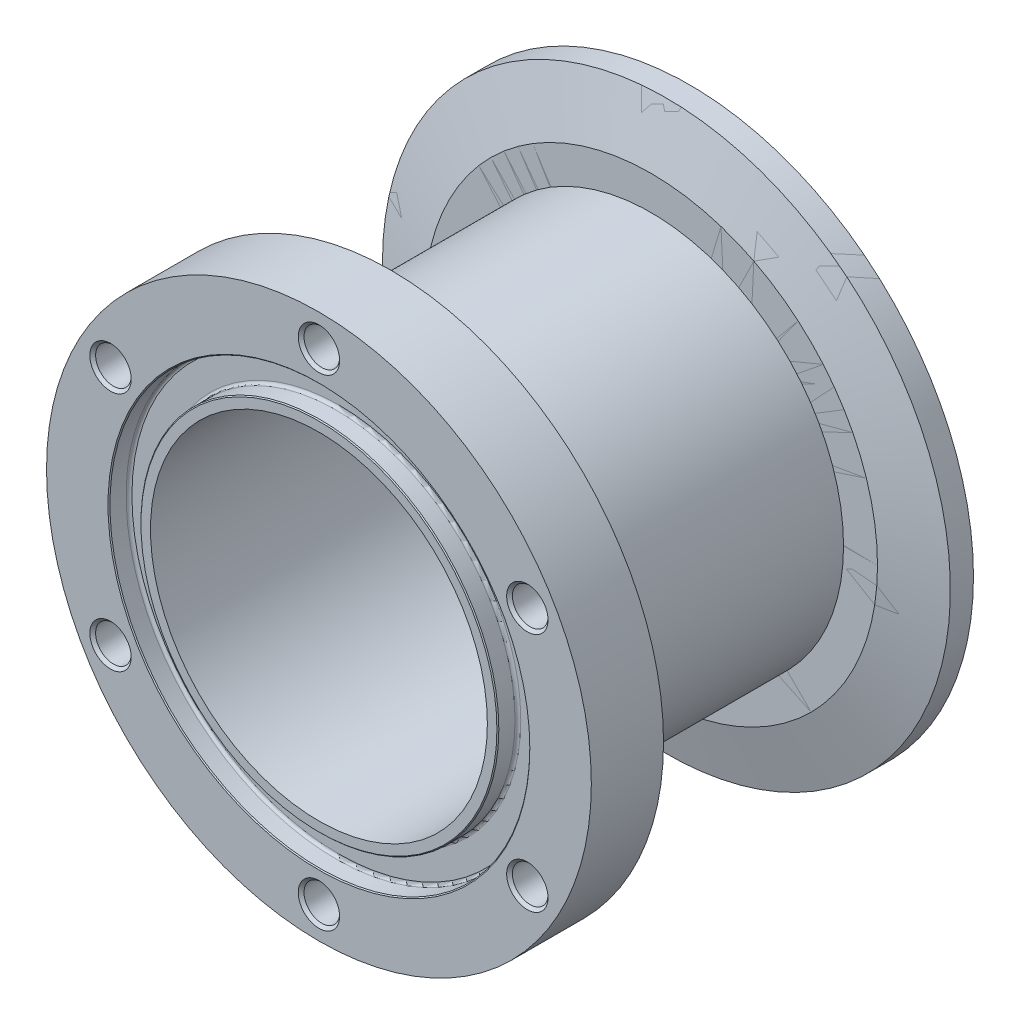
ISO-10303-21;
HEADER;
FILE_DESCRIPTION(('STEP AP214'),'2;1');
FILE_NAME('part.step','',(''),(''),'','','');
FILE_SCHEMA(('AUTOMOTIVE_DESIGN { 1 0 10303 214 1 1 1 1 }'));
ENDSEC;
DATA;
#1=APPLICATION_CONTEXT('core data for automotive mechanical design processes');
#2=APPLICATION_PROTOCOL_DEFINITION('international standard','automotive_design',2000,#1);
#3=PRODUCT_CONTEXT('',#1,'mechanical');
#4=PRODUCT('Part','Part','',(#3));
#5=PRODUCT_RELATED_PRODUCT_CATEGORY('part','',(#4));
#6=PRODUCT_DEFINITION_FORMATION('','',#4);
#7=PRODUCT_DEFINITION_CONTEXT('part definition',#1,'design');
#8=PRODUCT_DEFINITION('design','',#6,#7);
#9=PRODUCT_DEFINITION_SHAPE('','',#8);
#10=(LENGTH_UNIT() NAMED_UNIT(*) SI_UNIT(.MILLI.,.METRE.));
#11=(NAMED_UNIT(*) PLANE_ANGLE_UNIT() SI_UNIT($,.RADIAN.));
#12=(NAMED_UNIT(*) SI_UNIT($,.STERADIAN.) SOLID_ANGLE_UNIT());
#13=UNCERTAINTY_MEASURE_WITH_UNIT(LENGTH_MEASURE(1.E-05),#10,'distance_accuracy_value','');
#14=(GEOMETRIC_REPRESENTATION_CONTEXT(3) GLOBAL_UNCERTAINTY_ASSIGNED_CONTEXT((#13)) GLOBAL_UNIT_ASSIGNED_CONTEXT((#10,
#11,#12)) REPRESENTATION_CONTEXT('',''));
#15=CARTESIAN_POINT('',(0.,0.,0.));
#16=DIRECTION('',(0.,0.,1.));
#17=DIRECTION('',(1.,0.,0.));
#18=AXIS2_PLACEMENT_3D('',#15,#16,#17);
#19=CARTESIAN_POINT('',(0.,0.,46.355));
#20=DIRECTION('',(0.,0.,1.));
#21=DIRECTION('',(1.,0.,0.));
#22=AXIS2_PLACEMENT_3D('',#19,#20,#21);
#23=PLANE('',#22);
#24=CARTESIAN_POINT('',(0.,0.,46.355));
#25=DIRECTION('',(0.,0.,1.));
#26=DIRECTION('',(1.,0.,0.));
#27=AXIS2_PLACEMENT_3D('',#24,#25,#26);
#28=CIRCLE('',#27,23.4823);
#29=CARTESIAN_POINT('',(23.4823,0.,46.355));
#30=VERTEX_POINT('',#29);
#31=EDGE_CURVE('P0_E132',#30,#30,#28,.T.);
#32=ORIENTED_EDGE('',*,*,#31,.T.);
#33=EDGE_LOOP('',(#32));
#34=FACE_BOUND('',#33,.T.);
#35=CARTESIAN_POINT('',(0.,0.,46.355));
#36=DIRECTION('',(0.,0.,1.));
#37=DIRECTION('',(1.,0.,0.));
#38=AXIS2_PLACEMENT_3D('',#35,#36,#37);
#39=CIRCLE('',#38,22.225);
#40=CARTESIAN_POINT('',(22.225,0.,46.355));
#41=VERTEX_POINT('',#40);
#42=EDGE_CURVE('P0_E94',#41,#41,#39,.T.);
#43=ORIENTED_EDGE('',*,*,#42,.F.);
#44=EDGE_LOOP('',(#43));
#45=FACE_BOUND('',#44,.T.);
#46=ADVANCED_FACE('P0_F42',(#34,#45),#23,.T.);
#47=CARTESIAN_POINT('',(0.,0.,2.54));
#48=DIRECTION('',(0.,0.,-1.));
#49=DIRECTION('',(0.,-1.,0.));
#50=AXIS2_PLACEMENT_3D('',#47,#48,#49);
#51=PLANE('',#50);
#52=CARTESIAN_POINT('',(0.,0.,2.54));
#53=DIRECTION('',(0.,0.,-1.));
#54=DIRECTION('',(-1.,0.,0.));
#55=AXIS2_PLACEMENT_3D('',#52,#53,#54);
#56=CIRCLE('',#55,29.88147275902);
#57=CARTESIAN_POINT('',(-29.88147275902,0.,2.54));
#58=VERTEX_POINT('',#57);
#59=EDGE_CURVE('P0_E57',#58,#58,#56,.T.);
#60=ORIENTED_EDGE('',*,*,#59,.F.);
#61=EDGE_LOOP('',(#60));
#62=FACE_BOUND('',#61,.T.);
#63=CARTESIAN_POINT('',(0.,0.,2.54));
#64=DIRECTION('',(0.,0.,-1.));
#65=DIRECTION('',(-1.,0.,0.));
#66=AXIS2_PLACEMENT_3D('',#63,#64,#65);
#67=CIRCLE('',#66,25.4);
#68=CARTESIAN_POINT('',(-25.4,0.,2.54));
#69=VERTEX_POINT('',#68);
#70=EDGE_CURVE('P0_E84',#69,#69,#67,.F.);
#71=ORIENTED_EDGE('',*,*,#70,.F.);
#72=EDGE_LOOP('',(#71));
#73=FACE_BOUND('',#72,.T.);
#74=ADVANCED_FACE('P0_F153',(#62,#73),#51,.F.);
#75=CARTESIAN_POINT('',(0.,0.,-2.54));
#76=DIRECTION('',(0.,0.,1.));
#77=DIRECTION('',(1.,0.,0.));
#78=AXIS2_PLACEMENT_3D('',#75,#76,#77);
#79=CYLINDRICAL_SURFACE('',#78,22.225);
#80=CARTESIAN_POINT('',(0.,0.,0.127000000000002));
#81=DIRECTION('',(0.,0.,-1.));
#82=DIRECTION('',(-1.,0.,0.));
#83=AXIS2_PLACEMENT_3D('',#80,#81,#82);
#84=CIRCLE('',#83,22.225);
#85=CARTESIAN_POINT('',(-22.225,0.,0.127000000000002));
#86=VERTEX_POINT('',#85);
#87=EDGE_CURVE('P0_E87',#86,#86,#84,.F.);
#88=ORIENTED_EDGE('',*,*,#87,.F.);
#89=EDGE_LOOP('',(#88));
#90=FACE_BOUND('',#89,.T.);
#91=ORIENTED_EDGE('',*,*,#42,.T.);
#92=EDGE_LOOP('',(#91));
#93=FACE_BOUND('',#92,.T.);
#94=ADVANCED_FACE('P0_F160',(#90,#93),#79,.F.);
#95=CARTESIAN_POINT('',(0.,0.,0.508));
#96=DIRECTION('',(0.,0.,-1.));
#97=DIRECTION('',(-1.,0.,0.));
#98=AXIS2_PLACEMENT_3D('',#95,#96,#97);
#99=CONICAL_SURFACE('',#98,37.465,1.30899693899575);
#100=ORIENTED_EDGE('',*,*,#59,.T.);
#101=EDGE_LOOP('',(#100));
#102=FACE_BOUND('',#101,.T.);
#103=CARTESIAN_POINT('',(0.,0.,0.508));
#104=DIRECTION('',(0.,0.,-1.));
#105=DIRECTION('',(-1.,0.,0.));
#106=AXIS2_PLACEMENT_3D('',#103,#104,#105);
#107=CIRCLE('',#106,37.465);
#108=CARTESIAN_POINT('',(-37.465,0.,0.508));
#109=VERTEX_POINT('',#108);
#110=EDGE_CURVE('P0_E75',#109,#109,#107,.T.);
#111=ORIENTED_EDGE('',*,*,#110,.F.);
#112=EDGE_LOOP('',(#111));
#113=FACE_BOUND('',#112,.T.);
#114=ADVANCED_FACE('P0_F219',(#102,#113),#99,.T.);
#115=CARTESIAN_POINT('',(0.,0.,-57.));
#116=DIRECTION('',(0.,0.,1.));
#117=DIRECTION('',(-1.,0.,0.));
#118=AXIS2_PLACEMENT_3D('',#115,#116,#117);
#119=CYLINDRICAL_SURFACE('',#118,26.2255);
#120=CARTESIAN_POINT('',(0.,0.,-2.54));
#121=DIRECTION('',(0.,0.,-1.));
#122=DIRECTION('',(-1.,0.,0.));
#123=AXIS2_PLACEMENT_3D('',#120,#121,#122);
#124=CIRCLE('',#123,26.2255);
#125=CARTESIAN_POINT('',(-26.2255,0.,-2.54));
#126=VERTEX_POINT('',#125);
#127=EDGE_CURVE('P0_E71',#126,#126,#124,.T.);
#128=ORIENTED_EDGE('',*,*,#127,.T.);
#129=EDGE_LOOP('',(#128));
#130=FACE_BOUND('',#129,.T.);
#131=CARTESIAN_POINT('',(0.,0.,0.127000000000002));
#132=DIRECTION('',(0.,0.,-1.));
#133=DIRECTION('',(-1.,0.,0.));
#134=AXIS2_PLACEMENT_3D('',#131,#132,#133);
#135=CIRCLE('',#134,26.2255);
#136=CARTESIAN_POINT('',(-26.2255,0.,0.127000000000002));
#137=VERTEX_POINT('',#136);
#138=EDGE_CURVE('P0_E78',#137,#137,#135,.T.);
#139=ORIENTED_EDGE('',*,*,#138,.F.);
#140=EDGE_LOOP('',(#139));
#141=FACE_BOUND('',#140,.T.);
#142=ADVANCED_FACE('P0_F226',(#130,#141),#119,.F.);
#143=CARTESIAN_POINT('',(0.,23.0505,0.127));
#144=DIRECTION('',(0.,0.,-1.));
#145=DIRECTION('',(0.,-1.,0.));
#146=AXIS2_PLACEMENT_3D('',#143,#144,#145);
#147=PLANE('',#146);
#148=ORIENTED_EDGE('',*,*,#138,.T.);
#149=EDGE_LOOP('',(#148));
#150=FACE_BOUND('',#149,.T.);
#151=ORIENTED_EDGE('',*,*,#87,.T.);
#152=EDGE_LOOP('',(#151));
#153=FACE_BOUND('',#152,.T.);
#154=ADVANCED_FACE('P0_F215',(#150,#153),#147,.T.);
#155=CARTESIAN_POINT('',(0.,0.,2.54));
#156=DIRECTION('',(0.,0.,1.));
#157=DIRECTION('',(-1.,0.,0.));
#158=AXIS2_PLACEMENT_3D('',#155,#156,#157);
#159=CYLINDRICAL_SURFACE('',#158,37.465);
#160=CARTESIAN_POINT('',(0.,0.,-2.54));
#161=DIRECTION('',(0.,0.,-1.));
#162=DIRECTION('',(1.,0.,0.));
#163=AXIS2_PLACEMENT_3D('',#160,#161,#162);
#164=CIRCLE('',#163,37.465);
#165=CARTESIAN_POINT('',(37.465,0.,-2.54));
#166=VERTEX_POINT('',#165);
#167=EDGE_CURVE('P0_E67',#166,#166,#164,.T.);
#168=ORIENTED_EDGE('',*,*,#167,.F.);
#169=EDGE_LOOP('',(#168));
#170=FACE_BOUND('',#169,.T.);
#171=ORIENTED_EDGE('',*,*,#110,.T.);
#172=EDGE_LOOP('',(#171));
#173=FACE_BOUND('',#172,.T.);
#174=ADVANCED_FACE('P0_F76',(#170,#173),#159,.T.);
#175=CARTESIAN_POINT('',(0.,0.,-2.54));
#176=DIRECTION('',(0.,0.,-1.));
#177=DIRECTION('',(0.,-1.,0.));
#178=AXIS2_PLACEMENT_3D('',#175,#176,#177);
#179=PLANE('',#178);
#180=ORIENTED_EDGE('',*,*,#127,.F.);
#181=EDGE_LOOP('',(#180));
#182=FACE_BOUND('',#181,.T.);
#183=ORIENTED_EDGE('',*,*,#167,.T.);
#184=EDGE_LOOP('',(#183));
#185=FACE_BOUND('',#184,.T.);
#186=ADVANCED_FACE('P0_F176',(#182,#185),#179,.T.);
#187=CARTESIAN_POINT('',(0.,0.,36.83));
#188=DIRECTION('',(0.,0.,-1.));
#189=DIRECTION('',(-1.,0.,0.));
#190=AXIS2_PLACEMENT_3D('',#187,#188,#189);
#191=CYLINDRICAL_SURFACE('',#190,25.4);
#192=CARTESIAN_POINT('',(0.,0.,36.83));
#193=DIRECTION('',(0.,0.,1.));
#194=DIRECTION('',(1.,0.,0.));
#195=AXIS2_PLACEMENT_3D('',#192,#193,#194);
#196=CIRCLE('',#195,25.4);
#197=CARTESIAN_POINT('',(25.4,0.,36.83));
#198=VERTEX_POINT('',#197);
#199=EDGE_CURVE('P0_E203',#198,#198,#196,.T.);
#200=ORIENTED_EDGE('',*,*,#199,.F.);
#201=EDGE_LOOP('',(#200));
#202=FACE_BOUND('',#201,.T.);
#203=ORIENTED_EDGE('',*,*,#70,.T.);
#204=EDGE_LOOP('',(#203));
#205=FACE_BOUND('',#204,.T.);
#206=ADVANCED_FACE('P0_F168',(#202,#205),#191,.T.);
#207=CARTESIAN_POINT('',(0.,0.,46.355));
#208=DIRECTION('',(0.,0.,1.));
#209=DIRECTION('',(1.,0.,0.));
#210=AXIS2_PLACEMENT_3D('',#207,#208,#209);
#211=CIRCLE('',#210,27.8257);
#212=CARTESIAN_POINT('',(27.8257,0.,46.355));
#213=VERTEX_POINT('',#212);
#214=EDGE_CURVE('P0_E11',#213,#213,#211,.F.);
#215=ORIENTED_EDGE('',*,*,#214,.T.);
#216=EDGE_LOOP('',(#215));
#217=FACE_BOUND('',#216,.T.);
#218=CARTESIAN_POINT('',(0.,31.75,46.355));
#219=DIRECTION('',(0.,0.,1.));
#220=DIRECTION('',(1.,0.,0.));
#221=AXIS2_PLACEMENT_3D('',#218,#219,#220);
#222=CIRCLE('',#221,2.7305);
#223=CARTESIAN_POINT('',(2.7305,31.75,46.355));
#224=VERTEX_POINT('',#223);
#225=EDGE_CURVE('P0_E183',#224,#224,#222,.T.);
#226=ORIENTED_EDGE('',*,*,#225,.F.);
#227=EDGE_LOOP('',(#226));
#228=FACE_BOUND('',#227,.T.);
#229=CARTESIAN_POINT('',(27.4963065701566,15.8750000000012,46.355));
#230=DIRECTION('',(0.,0.,1.));
#231=DIRECTION('',(1.,0.,0.));
#232=AXIS2_PLACEMENT_3D('',#229,#230,#231);
#233=CIRCLE('',#232,2.7305);
#234=CARTESIAN_POINT('',(30.2268065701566,15.8750000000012,46.355));
#235=VERTEX_POINT('',#234);
#236=EDGE_CURVE('P0_E119',#235,#235,#233,.T.);
#237=ORIENTED_EDGE('',*,*,#236,.F.);
#238=EDGE_LOOP('',(#237));
#239=FACE_BOUND('',#238,.T.);
#240=CARTESIAN_POINT('',(27.496306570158,-15.8749999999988,46.355));
#241=DIRECTION('',(0.,0.,1.));
#242=DIRECTION('',(1.,0.,0.));
#243=AXIS2_PLACEMENT_3D('',#240,#241,#242);
#244=CIRCLE('',#243,2.7305);
#245=CARTESIAN_POINT('',(30.226806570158,-15.8749999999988,46.355));
#246=VERTEX_POINT('',#245);
#247=EDGE_CURVE('P0_E114',#246,#246,#244,.T.);
#248=ORIENTED_EDGE('',*,*,#247,.F.);
#249=EDGE_LOOP('',(#248));
#250=FACE_BOUND('',#249,.T.);
#251=CARTESIAN_POINT('',(2.6955030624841E-12,-31.75,46.355));
#252=DIRECTION('',(0.,0.,1.));
#253=DIRECTION('',(1.,0.,0.));
#254=AXIS2_PLACEMENT_3D('',#251,#252,#253);
#255=CIRCLE('',#254,2.7305);
#256=CARTESIAN_POINT('',(2.7305000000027,-31.75,46.355));
#257=VERTEX_POINT('',#256);
#258=EDGE_CURVE('P0_E109',#257,#257,#255,.T.);
#259=ORIENTED_EDGE('',*,*,#258,.F.);
#260=EDGE_LOOP('',(#259));
#261=FACE_BOUND('',#260,.T.);
#262=CARTESIAN_POINT('',(-27.4963065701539,-15.8750000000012,46.355));
#263=DIRECTION('',(0.,0.,1.));
#264=DIRECTION('',(1.,0.,0.));
#265=AXIS2_PLACEMENT_3D('',#262,#263,#264);
#266=CIRCLE('',#265,2.7305);
#267=CARTESIAN_POINT('',(-24.7658065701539,-15.8750000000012,46.355));
#268=VERTEX_POINT('',#267);
#269=EDGE_CURVE('P0_E104',#268,#268,#266,.T.);
#270=ORIENTED_EDGE('',*,*,#269,.F.);
#271=EDGE_LOOP('',(#270));
#272=FACE_BOUND('',#271,.T.);
#273=CARTESIAN_POINT('',(-27.4963065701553,15.8749999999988,46.355));
#274=DIRECTION('',(0.,0.,1.));
#275=DIRECTION('',(1.,0.,0.));
#276=AXIS2_PLACEMENT_3D('',#273,#274,#275);
#277=CIRCLE('',#276,2.7305);
#278=CARTESIAN_POINT('',(-24.7658065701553,15.8749999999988,46.355));
#279=VERTEX_POINT('',#278);
#280=EDGE_CURVE('P0_E99',#279,#279,#277,.T.);
#281=ORIENTED_EDGE('',*,*,#280,.F.);
#282=EDGE_LOOP('',(#281));
#283=FACE_BOUND('',#282,.T.);
#284=CARTESIAN_POINT('',(0.,0.,46.355));
#285=DIRECTION('',(0.,0.,1.));
#286=DIRECTION('',(1.,0.,0.));
#287=AXIS2_PLACEMENT_3D('',#284,#285,#286);
#288=CIRCLE('',#287,35.941);
#289=CARTESIAN_POINT('',(-35.941,0.,46.355));
#290=VERTEX_POINT('',#289);
#291=EDGE_CURVE('P0_E201',#290,#290,#288,.T.);
#292=ORIENTED_EDGE('',*,*,#291,.T.);
#293=EDGE_LOOP('',(#292));
#294=FACE_BOUND('',#293,.T.);
#295=ADVANCED_FACE('P0_F156',(#217,#228,#239,#250,#261,#272,#283,#294),#23,.T.);
#296=CARTESIAN_POINT('',(0.,0.,36.83));
#297=DIRECTION('',(0.,0.,1.));
#298=DIRECTION('',(1.,0.,0.));
#299=AXIS2_PLACEMENT_3D('',#296,#297,#298);
#300=PLANE('',#299);
#301=CARTESIAN_POINT('',(0.,31.75,36.83));
#302=DIRECTION('',(0.,0.,1.));
#303=DIRECTION('',(1.,0.,0.));
#304=AXIS2_PLACEMENT_3D('',#301,#302,#303);
#305=CIRCLE('',#304,2.3495);
#306=CARTESIAN_POINT('',(2.3495,31.75,36.83));
#307=VERTEX_POINT('',#306);
#308=EDGE_CURVE('P0_E116',#307,#307,#305,.T.);
#309=ORIENTED_EDGE('',*,*,#308,.T.);
#310=EDGE_LOOP('',(#309));
#311=FACE_BOUND('',#310,.T.);
#312=CARTESIAN_POINT('',(27.4963065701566,15.8750000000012,36.83));
#313=DIRECTION('',(0.,0.,1.));
#314=DIRECTION('',(1.,0.,0.));
#315=AXIS2_PLACEMENT_3D('',#312,#313,#314);
#316=CIRCLE('',#315,2.3495);
#317=CARTESIAN_POINT('',(29.8458065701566,15.8750000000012,36.83));
#318=VERTEX_POINT('',#317);
#319=EDGE_CURVE('P0_E111',#318,#318,#316,.T.);
#320=ORIENTED_EDGE('',*,*,#319,.T.);
#321=EDGE_LOOP('',(#320));
#322=FACE_BOUND('',#321,.T.);
#323=CARTESIAN_POINT('',(27.496306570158,-15.8749999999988,36.83));
#324=DIRECTION('',(0.,0.,1.));
#325=DIRECTION('',(1.,0.,0.));
#326=AXIS2_PLACEMENT_3D('',#323,#324,#325);
#327=CIRCLE('',#326,2.3495);
#328=CARTESIAN_POINT('',(29.845806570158,-15.8749999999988,36.83));
#329=VERTEX_POINT('',#328);
#330=EDGE_CURVE('P0_E106',#329,#329,#327,.T.);
#331=ORIENTED_EDGE('',*,*,#330,.T.);
#332=EDGE_LOOP('',(#331));
#333=FACE_BOUND('',#332,.T.);
#334=CARTESIAN_POINT('',(2.6955030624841E-12,-31.75,36.83));
#335=DIRECTION('',(0.,0.,1.));
#336=DIRECTION('',(1.,0.,0.));
#337=AXIS2_PLACEMENT_3D('',#334,#335,#336);
#338=CIRCLE('',#337,2.3495);
#339=CARTESIAN_POINT('',(2.34950000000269,-31.75,36.83));
#340=VERTEX_POINT('',#339);
#341=EDGE_CURVE('P0_E101',#340,#340,#338,.T.);
#342=ORIENTED_EDGE('',*,*,#341,.T.);
#343=EDGE_LOOP('',(#342));
#344=FACE_BOUND('',#343,.T.);
#345=CARTESIAN_POINT('',(-27.4963065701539,-15.8750000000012,36.83));
#346=DIRECTION('',(0.,0.,1.));
#347=DIRECTION('',(1.,0.,0.));
#348=AXIS2_PLACEMENT_3D('',#345,#346,#347);
#349=CIRCLE('',#348,2.3495);
#350=CARTESIAN_POINT('',(-25.1468065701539,-15.8750000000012,36.83));
#351=VERTEX_POINT('',#350);
#352=EDGE_CURVE('P0_E96',#351,#351,#349,.T.);
#353=ORIENTED_EDGE('',*,*,#352,.T.);
#354=EDGE_LOOP('',(#353));
#355=FACE_BOUND('',#354,.T.);
#356=CARTESIAN_POINT('',(-27.4963065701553,15.8749999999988,36.83));
#357=DIRECTION('',(0.,0.,1.));
#358=DIRECTION('',(1.,0.,0.));
#359=AXIS2_PLACEMENT_3D('',#356,#357,#358);
#360=CIRCLE('',#359,2.3495);
#361=CARTESIAN_POINT('',(-25.1468065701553,15.8749999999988,36.83));
#362=VERTEX_POINT('',#361);
#363=EDGE_CURVE('P0_E91',#362,#362,#360,.T.);
#364=ORIENTED_EDGE('',*,*,#363,.T.);
#365=EDGE_LOOP('',(#364));
#366=FACE_BOUND('',#365,.T.);
#367=ORIENTED_EDGE('',*,*,#199,.T.);
#368=EDGE_LOOP('',(#367));
#369=FACE_BOUND('',#368,.T.);
#370=CARTESIAN_POINT('',(0.,0.,36.83));
#371=DIRECTION('',(0.,0.,1.));
#372=DIRECTION('',(1.,0.,0.));
#373=AXIS2_PLACEMENT_3D('',#370,#371,#372);
#374=CIRCLE('',#373,35.941);
#375=CARTESIAN_POINT('',(-35.941,0.,36.83));
#376=VERTEX_POINT('',#375);
#377=EDGE_CURVE('P0_E204',#376,#376,#374,.T.);
#378=ORIENTED_EDGE('',*,*,#377,.F.);
#379=EDGE_LOOP('',(#378));
#380=FACE_BOUND('',#379,.T.);
#381=ADVANCED_FACE('P0_F167',(#311,#322,#333,#344,#355,#366,#369,#380),#300,.F.);
#382=CARTESIAN_POINT('',(0.,0.,46.355));
#383=DIRECTION('',(0.,0.,-1.));
#384=DIRECTION('',(-1.,0.,0.));
#385=AXIS2_PLACEMENT_3D('',#382,#383,#384);
#386=CYLINDRICAL_SURFACE('',#385,35.941);
#387=CARTESIAN_POINT('',(-35.941,0.,46.355));
#388=CARTESIAN_POINT('',(-35.941,0.,46.25578125));
#389=CARTESIAN_POINT('',(-35.941,0.,46.1565625));
#390=CARTESIAN_POINT('',(-35.941,0.,45.958125));
#391=CARTESIAN_POINT('',(-35.941,0.,45.85890625));
#392=CARTESIAN_POINT('',(-35.941,0.,45.66046875));
#393=CARTESIAN_POINT('',(-35.941,0.,45.56125));
#394=CARTESIAN_POINT('',(-35.941,0.,45.3628125));
#395=CARTESIAN_POINT('',(-35.941,0.,45.26359375));
#396=CARTESIAN_POINT('',(-35.941,0.,45.06515625));
#397=CARTESIAN_POINT('',(-35.941,0.,44.9659375));
#398=CARTESIAN_POINT('',(-35.941,0.,44.7675));
#399=CARTESIAN_POINT('',(-35.941,0.,44.66828125));
#400=CARTESIAN_POINT('',(-35.941,0.,44.46984375));
#401=CARTESIAN_POINT('',(-35.941,0.,44.370625));
#402=CARTESIAN_POINT('',(-35.941,0.,44.1721875));
#403=CARTESIAN_POINT('',(-35.941,0.,44.07296875));
#404=CARTESIAN_POINT('',(-35.941,0.,43.87453125));
#405=CARTESIAN_POINT('',(-35.941,0.,43.7753125));
#406=CARTESIAN_POINT('',(-35.941,0.,43.576875));
#407=CARTESIAN_POINT('',(-35.941,0.,43.47765625));
#408=CARTESIAN_POINT('',(-35.941,0.,43.27921875));
#409=CARTESIAN_POINT('',(-35.941,0.,43.18));
#410=CARTESIAN_POINT('',(-35.941,0.,42.9815625));
#411=CARTESIAN_POINT('',(-35.941,0.,42.88234375));
#412=CARTESIAN_POINT('',(-35.941,0.,42.68390625));
#413=CARTESIAN_POINT('',(-35.941,0.,42.5846875));
#414=CARTESIAN_POINT('',(-35.941,0.,42.38625));
#415=CARTESIAN_POINT('',(-35.941,0.,42.28703125));
#416=CARTESIAN_POINT('',(-35.941,0.,42.08859375));
#417=CARTESIAN_POINT('',(-35.941,0.,41.989375));
#418=CARTESIAN_POINT('',(-35.941,0.,41.7909375));
#419=CARTESIAN_POINT('',(-35.941,0.,41.69171875));
#420=CARTESIAN_POINT('',(-35.941,0.,41.49328125));
#421=CARTESIAN_POINT('',(-35.941,0.,41.3940625));
#422=CARTESIAN_POINT('',(-35.941,0.,41.195625));
#423=CARTESIAN_POINT('',(-35.941,0.,41.09640625));
#424=CARTESIAN_POINT('',(-35.941,0.,40.89796875));
#425=CARTESIAN_POINT('',(-35.941,0.,40.79875));
#426=CARTESIAN_POINT('',(-35.941,0.,40.6003125));
#427=CARTESIAN_POINT('',(-35.941,0.,40.50109375));
#428=CARTESIAN_POINT('',(-35.941,0.,40.30265625));
#429=CARTESIAN_POINT('',(-35.941,0.,40.2034375));
#430=CARTESIAN_POINT('',(-35.941,0.,40.005));
#431=CARTESIAN_POINT('',(-35.941,0.,39.90578125));
#432=CARTESIAN_POINT('',(-35.941,0.,39.70734375));
#433=CARTESIAN_POINT('',(-35.941,0.,39.608125));
#434=CARTESIAN_POINT('',(-35.941,0.,39.4096875));
#435=CARTESIAN_POINT('',(-35.941,0.,39.31046875));
#436=CARTESIAN_POINT('',(-35.941,0.,39.11203125));
#437=CARTESIAN_POINT('',(-35.941,0.,39.0128125));
#438=CARTESIAN_POINT('',(-35.941,0.,38.814375));
#439=CARTESIAN_POINT('',(-35.941,0.,38.71515625));
#440=CARTESIAN_POINT('',(-35.941,0.,38.51671875));
#441=CARTESIAN_POINT('',(-35.941,0.,38.4175));
#442=CARTESIAN_POINT('',(-35.941,0.,38.2190625));
#443=CARTESIAN_POINT('',(-35.941,0.,38.11984375));
#444=CARTESIAN_POINT('',(-35.941,0.,37.92140625));
#445=CARTESIAN_POINT('',(-35.941,0.,37.8221875));
#446=CARTESIAN_POINT('',(-35.941,0.,37.62375));
#447=CARTESIAN_POINT('',(-35.941,0.,37.52453125));
#448=CARTESIAN_POINT('',(-35.941,0.,37.32609375));
#449=CARTESIAN_POINT('',(-35.941,0.,37.226875));
#450=CARTESIAN_POINT('',(-35.941,0.,37.0284375));
#451=CARTESIAN_POINT('',(-35.941,0.,36.92921875));
#452=CARTESIAN_POINT('',(-35.941,0.,36.83));
#453=B_SPLINE_CURVE_WITH_KNOTS('',3,(#387,#388,#389,#390,#391,#392,#393,#394,#395,#396,#397,
#398,#399,#400,#401,#402,#403,#404,#405,#406,#407,#408,#409,#410,#411,#412,#413,#414,#415,#416,
#417,#418,#419,#420,#421,#422,#423,#424,#425,#426,#427,#428,#429,#430,#431,#432,#433,#434,#435,
#436,#437,#438,#439,#440,#441,#442,#443,#444,#445,#446,#447,#448,#449,#450,#451,#452),
.UNSPECIFIED.,.F.,.F.,(4,2,2,2,2,2,2,2,2,2,2,2,2,2,2,2,2,2,2,2,2,2,2,2,2,2,2,2,2,2,2,2,4),(0.,
0.29765625,0.5953125,0.892968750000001,1.190625,1.48828125,1.7859375,2.08359375,2.38125,
2.67890625,2.9765625,3.27421875,3.571875,3.86953125,4.1671875,4.46484375,4.7625,5.06015625,
5.3578125,5.65546875,5.953125,6.25078125,6.5484375,6.84609375,7.14375,7.44140625,7.7390625,
8.03671875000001,8.334375,8.63203125,8.92968750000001,9.22734375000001,9.52500000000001),.UNSPECIFIED.);
#454=EDGE_CURVE('P0_BSEAM174',#290,#376,#453,.T.);
#455=ORIENTED_EDGE('',*,*,#291,.F.);
#456=ORIENTED_EDGE('',*,*,#377,.T.);
#457=ORIENTED_EDGE('',*,*,#454,.T.);
#458=ORIENTED_EDGE('',*,*,#454,.F.);
#459=EDGE_LOOP('',(#455,#457,#456,#458));
#460=FACE_BOUND('',#459,.T.);
#461=ADVANCED_FACE('P0_F174',(#460),#386,.T.);
#462=CARTESIAN_POINT('',(-27.4963065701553,15.8749999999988,46.355));
#463=DIRECTION('',(0.,0.,1.));
#464=DIRECTION('',(1.,0.,0.));
#465=AXIS2_PLACEMENT_3D('',#462,#463,#464);
#466=CYLINDRICAL_SURFACE('',#465,2.3495);
#467=CARTESIAN_POINT('',(-27.4963065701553,15.8749999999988,45.974));
#468=DIRECTION('',(0.,0.,1.));
#469=DIRECTION('',(1.,0.,0.));
#470=AXIS2_PLACEMENT_3D('',#467,#468,#469);
#471=CIRCLE('',#470,2.3495);
#472=CARTESIAN_POINT('',(-25.1468065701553,15.8749999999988,45.974));
#473=VERTEX_POINT('',#472);
#474=EDGE_CURVE('P0_E95',#473,#473,#471,.T.);
#475=ORIENTED_EDGE('',*,*,#474,.T.);
#476=EDGE_LOOP('',(#475));
#477=FACE_BOUND('',#476,.T.);
#478=ORIENTED_EDGE('',*,*,#363,.F.);
#479=EDGE_LOOP('',(#478));
#480=FACE_BOUND('',#479,.T.);
#481=ADVANCED_FACE('P0_F313',(#477,#480),#466,.F.);
#482=CARTESIAN_POINT('',(-27.4963065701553,15.8749999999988,46.355));
#483=DIRECTION('',(0.,0.,1.));
#484=DIRECTION('',(1.,0.,0.));
#485=AXIS2_PLACEMENT_3D('',#482,#483,#484);
#486=CONICAL_SURFACE('',#485,2.7305,0.785398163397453);
#487=ORIENTED_EDGE('',*,*,#474,.F.);
#488=EDGE_LOOP('',(#487));
#489=FACE_BOUND('',#488,.T.);
#490=ORIENTED_EDGE('',*,*,#280,.T.);
#491=EDGE_LOOP('',(#490));
#492=FACE_BOUND('',#491,.T.);
#493=ADVANCED_FACE('P0_F310',(#489,#492),#486,.F.);
#494=CARTESIAN_POINT('',(-27.4963065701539,-15.8750000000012,46.355));
#495=DIRECTION('',(0.,0.,1.));
#496=DIRECTION('',(1.,0.,0.));
#497=AXIS2_PLACEMENT_3D('',#494,#495,#496);
#498=CYLINDRICAL_SURFACE('',#497,2.3495);
#499=CARTESIAN_POINT('',(-27.4963065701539,-15.8750000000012,45.974));
#500=DIRECTION('',(0.,0.,1.));
#501=DIRECTION('',(1.,0.,0.));
#502=AXIS2_PLACEMENT_3D('',#499,#500,#501);
#503=CIRCLE('',#502,2.3495);
#504=CARTESIAN_POINT('',(-25.1468065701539,-15.8750000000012,45.974));
#505=VERTEX_POINT('',#504);
#506=EDGE_CURVE('P0_E100',#505,#505,#503,.T.);
#507=ORIENTED_EDGE('',*,*,#506,.T.);
#508=EDGE_LOOP('',(#507));
#509=FACE_BOUND('',#508,.T.);
#510=ORIENTED_EDGE('',*,*,#352,.F.);
#511=EDGE_LOOP('',(#510));
#512=FACE_BOUND('',#511,.T.);
#513=ADVANCED_FACE('P0_F306',(#509,#512),#498,.F.);
#514=CARTESIAN_POINT('',(-27.4963065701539,-15.8750000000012,46.355));
#515=DIRECTION('',(0.,0.,1.));
#516=DIRECTION('',(1.,0.,0.));
#517=AXIS2_PLACEMENT_3D('',#514,#515,#516);
#518=CONICAL_SURFACE('',#517,2.7305,0.785398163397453);
#519=ORIENTED_EDGE('',*,*,#506,.F.);
#520=EDGE_LOOP('',(#519));
#521=FACE_BOUND('',#520,.T.);
#522=ORIENTED_EDGE('',*,*,#269,.T.);
#523=EDGE_LOOP('',(#522));
#524=FACE_BOUND('',#523,.T.);
#525=ADVANCED_FACE('P0_F302',(#521,#524),#518,.F.);
#526=CARTESIAN_POINT('',(2.6955030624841E-12,-31.75,46.355));
#527=DIRECTION('',(0.,0.,1.));
#528=DIRECTION('',(1.,0.,0.));
#529=AXIS2_PLACEMENT_3D('',#526,#527,#528);
#530=CYLINDRICAL_SURFACE('',#529,2.3495);
#531=CARTESIAN_POINT('',(2.6955030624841E-12,-31.75,45.974));
#532=DIRECTION('',(0.,0.,1.));
#533=DIRECTION('',(1.,0.,0.));
#534=AXIS2_PLACEMENT_3D('',#531,#532,#533);
#535=CIRCLE('',#534,2.3495);
#536=CARTESIAN_POINT('',(2.34950000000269,-31.75,45.974));
#537=VERTEX_POINT('',#536);
#538=EDGE_CURVE('P0_E105',#537,#537,#535,.T.);
#539=ORIENTED_EDGE('',*,*,#538,.T.);
#540=EDGE_LOOP('',(#539));
#541=FACE_BOUND('',#540,.T.);
#542=ORIENTED_EDGE('',*,*,#341,.F.);
#543=EDGE_LOOP('',(#542));
#544=FACE_BOUND('',#543,.T.);
#545=ADVANCED_FACE('P0_F298',(#541,#544),#530,.F.);
#546=CARTESIAN_POINT('',(2.6955030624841E-12,-31.75,46.355));
#547=DIRECTION('',(0.,0.,1.));
#548=DIRECTION('',(1.,0.,0.));
#549=AXIS2_PLACEMENT_3D('',#546,#547,#548);
#550=CONICAL_SURFACE('',#549,2.7305,0.785398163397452);
#551=ORIENTED_EDGE('',*,*,#538,.F.);
#552=EDGE_LOOP('',(#551));
#553=FACE_BOUND('',#552,.T.);
#554=ORIENTED_EDGE('',*,*,#258,.T.);
#555=EDGE_LOOP('',(#554));
#556=FACE_BOUND('',#555,.T.);
#557=ADVANCED_FACE('P0_F294',(#553,#556),#550,.F.);
#558=CARTESIAN_POINT('',(27.496306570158,-15.8749999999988,46.355));
#559=DIRECTION('',(0.,0.,1.));
#560=DIRECTION('',(1.,0.,0.));
#561=AXIS2_PLACEMENT_3D('',#558,#559,#560);
#562=CYLINDRICAL_SURFACE('',#561,2.3495);
#563=CARTESIAN_POINT('',(27.496306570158,-15.8749999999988,45.974));
#564=DIRECTION('',(0.,0.,1.));
#565=DIRECTION('',(1.,0.,0.));
#566=AXIS2_PLACEMENT_3D('',#563,#564,#565);
#567=CIRCLE('',#566,2.3495);
#568=CARTESIAN_POINT('',(29.845806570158,-15.8749999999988,45.974));
#569=VERTEX_POINT('',#568);
#570=EDGE_CURVE('P0_E110',#569,#569,#567,.T.);
#571=ORIENTED_EDGE('',*,*,#570,.T.);
#572=EDGE_LOOP('',(#571));
#573=FACE_BOUND('',#572,.T.);
#574=ORIENTED_EDGE('',*,*,#330,.F.);
#575=EDGE_LOOP('',(#574));
#576=FACE_BOUND('',#575,.T.);
#577=ADVANCED_FACE('P0_F290',(#573,#576),#562,.F.);
#578=CARTESIAN_POINT('',(27.496306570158,-15.8749999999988,46.355));
#579=DIRECTION('',(0.,0.,1.));
#580=DIRECTION('',(1.,0.,0.));
#581=AXIS2_PLACEMENT_3D('',#578,#579,#580);
#582=CONICAL_SURFACE('',#581,2.7305,0.785398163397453);
#583=ORIENTED_EDGE('',*,*,#570,.F.);
#584=EDGE_LOOP('',(#583));
#585=FACE_BOUND('',#584,.T.);
#586=ORIENTED_EDGE('',*,*,#247,.T.);
#587=EDGE_LOOP('',(#586));
#588=FACE_BOUND('',#587,.T.);
#589=ADVANCED_FACE('P0_F286',(#585,#588),#582,.F.);
#590=CARTESIAN_POINT('',(27.4963065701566,15.8750000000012,46.355));
#591=DIRECTION('',(0.,0.,1.));
#592=DIRECTION('',(1.,0.,0.));
#593=AXIS2_PLACEMENT_3D('',#590,#591,#592);
#594=CYLINDRICAL_SURFACE('',#593,2.3495);
#595=CARTESIAN_POINT('',(27.4963065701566,15.8750000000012,45.974));
#596=DIRECTION('',(0.,0.,1.));
#597=DIRECTION('',(1.,0.,0.));
#598=AXIS2_PLACEMENT_3D('',#595,#596,#597);
#599=CIRCLE('',#598,2.3495);
#600=CARTESIAN_POINT('',(29.8458065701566,15.8750000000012,45.974));
#601=VERTEX_POINT('',#600);
#602=EDGE_CURVE('P0_E115',#601,#601,#599,.T.);
#603=ORIENTED_EDGE('',*,*,#602,.T.);
#604=EDGE_LOOP('',(#603));
#605=FACE_BOUND('',#604,.T.);
#606=ORIENTED_EDGE('',*,*,#319,.F.);
#607=EDGE_LOOP('',(#606));
#608=FACE_BOUND('',#607,.T.);
#609=ADVANCED_FACE('P0_F282',(#605,#608),#594,.F.);
#610=CARTESIAN_POINT('',(27.4963065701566,15.8750000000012,46.355));
#611=DIRECTION('',(0.,0.,1.));
#612=DIRECTION('',(1.,0.,0.));
#613=AXIS2_PLACEMENT_3D('',#610,#611,#612);
#614=CONICAL_SURFACE('',#613,2.7305,0.785398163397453);
#615=ORIENTED_EDGE('',*,*,#602,.F.);
#616=EDGE_LOOP('',(#615));
#617=FACE_BOUND('',#616,.T.);
#618=ORIENTED_EDGE('',*,*,#236,.T.);
#619=EDGE_LOOP('',(#618));
#620=FACE_BOUND('',#619,.T.);
#621=ADVANCED_FACE('P0_F278',(#617,#620),#614,.F.);
#622=CARTESIAN_POINT('',(0.,31.75,46.355));
#623=DIRECTION('',(0.,0.,1.));
#624=DIRECTION('',(1.,0.,0.));
#625=AXIS2_PLACEMENT_3D('',#622,#623,#624);
#626=CYLINDRICAL_SURFACE('',#625,2.3495);
#627=CARTESIAN_POINT('',(0.,31.75,45.974));
#628=DIRECTION('',(0.,0.,1.));
#629=DIRECTION('',(1.,0.,0.));
#630=AXIS2_PLACEMENT_3D('',#627,#628,#629);
#631=CIRCLE('',#630,2.3495);
#632=CARTESIAN_POINT('',(2.3495,31.75,45.974));
#633=VERTEX_POINT('',#632);
#634=EDGE_CURVE('P0_E120',#633,#633,#631,.T.);
#635=ORIENTED_EDGE('',*,*,#634,.T.);
#636=EDGE_LOOP('',(#635));
#637=FACE_BOUND('',#636,.T.);
#638=ORIENTED_EDGE('',*,*,#308,.F.);
#639=EDGE_LOOP('',(#638));
#640=FACE_BOUND('',#639,.T.);
#641=ADVANCED_FACE('P0_F274',(#637,#640),#626,.F.);
#642=CARTESIAN_POINT('',(0.,31.75,46.355));
#643=DIRECTION('',(0.,0.,1.));
#644=DIRECTION('',(1.,0.,0.));
#645=AXIS2_PLACEMENT_3D('',#642,#643,#644);
#646=CONICAL_SURFACE('',#645,2.7305,0.785398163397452);
#647=ORIENTED_EDGE('',*,*,#634,.F.);
#648=EDGE_LOOP('',(#647));
#649=FACE_BOUND('',#648,.T.);
#650=ORIENTED_EDGE('',*,*,#225,.T.);
#651=EDGE_LOOP('',(#650));
#652=FACE_BOUND('',#651,.T.);
#653=ADVANCED_FACE('P0_F269',(#649,#652),#646,.F.);
#654=CARTESIAN_POINT('',(0.,0.,43.7134));
#655=DIRECTION('',(0.,0.,1.));
#656=DIRECTION('',(1.,0.,0.));
#657=AXIS2_PLACEMENT_3D('',#654,#655,#656);
#658=CYLINDRICAL_SURFACE('',#657,27.6987);
#659=CARTESIAN_POINT('',(0.,0.,46.228));
#660=DIRECTION('',(0.,0.,1.));
#661=DIRECTION('',(1.,0.,0.));
#662=AXIS2_PLACEMENT_3D('',#659,#660,#661);
#663=CIRCLE('',#662,27.6987);
#664=CARTESIAN_POINT('',(27.6987,0.,46.228));
#665=VERTEX_POINT('',#664);
#666=EDGE_CURVE('P0_E52',#665,#665,#663,.T.);
#667=ORIENTED_EDGE('',*,*,#666,.T.);
#668=EDGE_LOOP('',(#667));
#669=FACE_BOUND('',#668,.T.);
#670=CARTESIAN_POINT('',(0.,0.,44.0944));
#671=DIRECTION('',(0.,0.,1.));
#672=DIRECTION('',(1.,0.,0.));
#673=AXIS2_PLACEMENT_3D('',#670,#671,#672);
#674=CIRCLE('',#673,27.6987);
#675=CARTESIAN_POINT('',(27.6987,0.,44.0944));
#676=VERTEX_POINT('',#675);
#677=EDGE_CURVE('P0_E129',#676,#676,#674,.F.);
#678=ORIENTED_EDGE('',*,*,#677,.T.);
#679=EDGE_LOOP('',(#678));
#680=FACE_BOUND('',#679,.T.);
#681=ADVANCED_FACE('P0_F140',(#669,#680),#658,.F.);
#682=CARTESIAN_POINT('',(0.,0.,43.7134));
#683=DIRECTION('',(0.,0.,1.));
#684=DIRECTION('',(1.,0.,0.));
#685=AXIS2_PLACEMENT_3D('',#682,#683,#684);
#686=PLANE('',#685);
#687=CARTESIAN_POINT('',(0.,0.,43.7134));
#688=DIRECTION('',(0.,0.,1.));
#689=DIRECTION('',(1.,0.,0.));
#690=AXIS2_PLACEMENT_3D('',#687,#688,#689);
#691=CIRCLE('',#690,23.9903);
#692=CARTESIAN_POINT('',(23.9903,0.,43.7134));
#693=VERTEX_POINT('',#692);
#694=EDGE_CURVE('P0_E126',#693,#693,#691,.F.);
#695=ORIENTED_EDGE('',*,*,#694,.T.);
#696=EDGE_LOOP('',(#695));
#697=FACE_BOUND('',#696,.T.);
#698=CARTESIAN_POINT('',(0.,0.,43.7134));
#699=DIRECTION('',(0.,0.,1.));
#700=DIRECTION('',(1.,0.,0.));
#701=AXIS2_PLACEMENT_3D('',#698,#699,#700);
#702=CIRCLE('',#701,27.3177);
#703=CARTESIAN_POINT('',(27.3177,0.,43.7134));
#704=VERTEX_POINT('',#703);
#705=EDGE_CURVE('P0_E123',#704,#704,#702,.T.);
#706=ORIENTED_EDGE('',*,*,#705,.T.);
#707=EDGE_LOOP('',(#706));
#708=FACE_BOUND('',#707,.T.);
#709=ADVANCED_FACE('P0_F259',(#697,#708),#686,.T.);
#710=CARTESIAN_POINT('',(0.,0.,43.7134));
#711=DIRECTION('',(0.,0.,1.));
#712=DIRECTION('',(1.,0.,0.));
#713=AXIS2_PLACEMENT_3D('',#710,#711,#712);
#714=CYLINDRICAL_SURFACE('',#713,23.6093);
#715=CARTESIAN_POINT('',(0.,0.,46.228));
#716=DIRECTION('',(0.,0.,1.));
#717=DIRECTION('',(1.,0.,0.));
#718=AXIS2_PLACEMENT_3D('',#715,#716,#717);
#719=CIRCLE('',#718,23.6093);
#720=CARTESIAN_POINT('',(23.6093,0.,46.228));
#721=VERTEX_POINT('',#720);
#722=EDGE_CURVE('P0_E135',#721,#721,#719,.F.);
#723=ORIENTED_EDGE('',*,*,#722,.T.);
#724=EDGE_LOOP('',(#723));
#725=FACE_BOUND('',#724,.T.);
#726=CARTESIAN_POINT('',(0.,0.,44.0944));
#727=DIRECTION('',(0.,0.,1.));
#728=DIRECTION('',(1.,0.,0.));
#729=AXIS2_PLACEMENT_3D('',#726,#727,#728);
#730=CIRCLE('',#729,23.6093);
#731=CARTESIAN_POINT('',(23.6093,0.,44.0944));
#732=VERTEX_POINT('',#731);
#733=EDGE_CURVE('P0_E90',#732,#732,#730,.T.);
#734=ORIENTED_EDGE('',*,*,#733,.T.);
#735=EDGE_LOOP('',(#734));
#736=FACE_BOUND('',#735,.T.);
#737=ADVANCED_FACE('P0_F244',(#725,#736),#714,.T.);
#738=CARTESIAN_POINT('',(0.,0.,44.0944));
#739=DIRECTION('',(0.,0.,1.));
#740=DIRECTION('',(1.,0.,0.));
#741=AXIS2_PLACEMENT_3D('',#738,#739,#740);
#742=TOROIDAL_SURFACE('',#741,23.9903,0.381);
#743=ORIENTED_EDGE('',*,*,#694,.F.);
#744=EDGE_LOOP('',(#743));
#745=FACE_BOUND('',#744,.T.);
#746=ORIENTED_EDGE('',*,*,#733,.F.);
#747=EDGE_LOOP('',(#746));
#748=FACE_BOUND('',#747,.T.);
#749=ADVANCED_FACE('P0_F241',(#745,#748),#742,.F.);
#750=CARTESIAN_POINT('',(0.,0.,44.0944));
#751=DIRECTION('',(0.,0.,1.));
#752=DIRECTION('',(1.,0.,0.));
#753=AXIS2_PLACEMENT_3D('',#750,#751,#752);
#754=TOROIDAL_SURFACE('',#753,27.3177,0.381);
#755=ORIENTED_EDGE('',*,*,#677,.F.);
#756=EDGE_LOOP('',(#755));
#757=FACE_BOUND('',#756,.T.);
#758=ORIENTED_EDGE('',*,*,#705,.F.);
#759=EDGE_LOOP('',(#758));
#760=FACE_BOUND('',#759,.T.);
#761=ADVANCED_FACE('P0_F149',(#757,#760),#754,.F.);
#762=CARTESIAN_POINT('',(0.,0.,46.355));
#763=DIRECTION('',(0.,0.,-1.));
#764=DIRECTION('',(-1.,0.,0.));
#765=AXIS2_PLACEMENT_3D('',#762,#763,#764);
#766=CONICAL_SURFACE('',#765,23.4823,0.785398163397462);
#767=ORIENTED_EDGE('',*,*,#722,.F.);
#768=EDGE_LOOP('',(#767));
#769=FACE_BOUND('',#768,.T.);
#770=ORIENTED_EDGE('',*,*,#31,.F.);
#771=EDGE_LOOP('',(#770));
#772=FACE_BOUND('',#771,.T.);
#773=ADVANCED_FACE('P0_F144',(#769,#772),#766,.T.);
#774=CARTESIAN_POINT('',(0.,0.,46.228));
#775=DIRECTION('',(0.,0.,1.));
#776=DIRECTION('',(1.,0.,0.));
#777=AXIS2_PLACEMENT_3D('',#774,#775,#776);
#778=CONICAL_SURFACE('',#777,27.6987,0.785398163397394);
#779=ORIENTED_EDGE('',*,*,#214,.F.);
#780=EDGE_LOOP('',(#779));
#781=FACE_BOUND('',#780,.T.);
#782=ORIENTED_EDGE('',*,*,#666,.F.);
#783=EDGE_LOOP('',(#782));
#784=FACE_BOUND('',#783,.T.);
#785=ADVANCED_FACE('P0_F45',(#781,#784),#778,.F.);
#786=CLOSED_SHELL('',(#46,#74,#94,#114,#142,#154,#174,#186,#206,#295,#381,#461,#481,#493,#513,
#525,#545,#557,#577,#589,#609,#621,#641,#653,#681,#709,#737,#749,#761,#773,#785));
#787=MANIFOLD_SOLID_BREP('P0_B2',#786);
#788=CARTESIAN_POINT('',(0.,0.,2.54));
#789=DIRECTION('',(0.,0.,-1.));
#790=DIRECTION('',(0.,-1.,0.));
#791=AXIS2_PLACEMENT_3D('',#788,#789,#790);
#792=PLANE('',#791);
#793=CARTESIAN_POINT('',(0.,0.,2.54));
#794=DIRECTION('',(0.,0.,1.));
#795=DIRECTION('',(-1.,0.,0.));
#796=AXIS2_PLACEMENT_3D('',#793,#794,#795);
#797=CIRCLE('',#796,6.4135);
#798=CARTESIAN_POINT('',(-6.4135,0.,2.54));
#799=VERTEX_POINT('',#798);
#800=EDGE_CURVE('P1_E27',#799,#799,#797,.T.);
#801=ORIENTED_EDGE('',*,*,#800,.F.);
#802=EDGE_LOOP('',(#801));
#803=FACE_BOUND('',#802,.T.);
#804=CARTESIAN_POINT('',(0.,0.,2.54));
#805=DIRECTION('',(0.,0.,-1.));
#806=DIRECTION('',(-1.,0.,0.));
#807=AXIS2_PLACEMENT_3D('',#804,#805,#806);
#808=CIRCLE('',#807,29.88147275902);
#809=CARTESIAN_POINT('',(-29.88147275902,0.,2.54));
#810=VERTEX_POINT('',#809);
#811=EDGE_CURVE('P1_E11',#810,#810,#808,.T.);
#812=ORIENTED_EDGE('',*,*,#811,.F.);
#813=EDGE_LOOP('',(#812));
#814=FACE_BOUND('',#813,.T.);
#815=ADVANCED_FACE('P1_F16',(#803,#814),#792,.F.);
#816=CARTESIAN_POINT('',(0.,0.,-2.54));
#817=DIRECTION('',(0.,0.,-1.));
#818=DIRECTION('',(0.,-1.,0.));
#819=AXIS2_PLACEMENT_3D('',#816,#817,#818);
#820=PLANE('',#819);
#821=CARTESIAN_POINT('',(0.,0.,-2.54));
#822=DIRECTION('',(0.,0.,1.));
#823=DIRECTION('',(0.,1.,0.));
#824=AXIS2_PLACEMENT_3D('',#821,#822,#823);
#825=CIRCLE('',#824,6.4135);
#826=CARTESIAN_POINT('',(0.,6.4135,-2.54));
#827=VERTEX_POINT('',#826);
#828=EDGE_CURVE('P1_E91',#827,#827,#825,.T.);
#829=ORIENTED_EDGE('',*,*,#828,.T.);
#830=EDGE_LOOP('',(#829));
#831=FACE_BOUND('',#830,.T.);
#832=CARTESIAN_POINT('',(0.,0.,-2.54));
#833=DIRECTION('',(0.,0.,-1.));
#834=DIRECTION('',(-1.,0.,0.));
#835=AXIS2_PLACEMENT_3D('',#832,#833,#834);
#836=CIRCLE('',#835,23.0505);
#837=CARTESIAN_POINT('',(-23.0505,0.,-2.54));
#838=VERTEX_POINT('',#837);
#839=EDGE_CURVE('P1_E88',#838,#838,#836,.T.);
#840=ORIENTED_EDGE('',*,*,#839,.T.);
#841=EDGE_LOOP('',(#840));
#842=FACE_BOUND('',#841,.T.);
#843=ADVANCED_FACE('P1_F112',(#831,#842),#820,.T.);
#844=CARTESIAN_POINT('',(0.,0.,0.508));
#845=DIRECTION('',(0.,0.,-1.));
#846=DIRECTION('',(-1.,0.,0.));
#847=AXIS2_PLACEMENT_3D('',#844,#845,#846);
#848=CONICAL_SURFACE('',#847,37.465,1.30899693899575);
#849=ORIENTED_EDGE('',*,*,#811,.T.);
#850=EDGE_LOOP('',(#849));
#851=FACE_BOUND('',#850,.T.);
#852=CARTESIAN_POINT('',(0.,0.,0.508));
#853=DIRECTION('',(0.,0.,-1.));
#854=DIRECTION('',(-1.,0.,0.));
#855=AXIS2_PLACEMENT_3D('',#852,#853,#854);
#856=CIRCLE('',#855,37.465);
#857=CARTESIAN_POINT('',(-37.465,0.,0.508));
#858=VERTEX_POINT('',#857);
#859=EDGE_CURVE('P1_E75',#858,#858,#856,.T.);
#860=ORIENTED_EDGE('',*,*,#859,.F.);
#861=EDGE_LOOP('',(#860));
#862=FACE_BOUND('',#861,.T.);
#863=ADVANCED_FACE('P1_F136',(#851,#862),#848,.T.);
#864=CARTESIAN_POINT('',(0.,0.,103.548718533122));
#865=DIRECTION('',(0.,0.,1.));
#866=DIRECTION('',(-1.,0.,0.));
#867=AXIS2_PLACEMENT_3D('',#864,#865,#866);
#868=CYLINDRICAL_SURFACE('',#867,6.4135);
#869=ORIENTED_EDGE('',*,*,#800,.T.);
#870=EDGE_LOOP('',(#869));
#871=FACE_BOUND('',#870,.T.);
#872=ORIENTED_EDGE('',*,*,#828,.F.);
#873=EDGE_LOOP('',(#872));
#874=FACE_BOUND('',#873,.T.);
#875=ADVANCED_FACE('P1_F18',(#871,#874),#868,.F.);
#876=CARTESIAN_POINT('',(0.,0.,-57.));
#877=DIRECTION('',(0.,0.,1.));
#878=DIRECTION('',(-1.,0.,0.));
#879=AXIS2_PLACEMENT_3D('',#876,#877,#878);
#880=CYLINDRICAL_SURFACE('',#879,26.2255);
#881=CARTESIAN_POINT('',(0.,0.,-2.54));
#882=DIRECTION('',(0.,0.,-1.));
#883=DIRECTION('',(-1.,0.,0.));
#884=AXIS2_PLACEMENT_3D('',#881,#882,#883);
#885=CIRCLE('',#884,26.2255);
#886=CARTESIAN_POINT('',(-26.2255,0.,-2.54));
#887=VERTEX_POINT('',#886);
#888=EDGE_CURVE('P1_E80',#887,#887,#885,.T.);
#889=ORIENTED_EDGE('',*,*,#888,.T.);
#890=EDGE_LOOP('',(#889));
#891=FACE_BOUND('',#890,.T.);
#892=CARTESIAN_POINT('',(0.,0.,0.127000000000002));
#893=DIRECTION('',(0.,0.,-1.));
#894=DIRECTION('',(-1.,0.,0.));
#895=AXIS2_PLACEMENT_3D('',#892,#893,#894);
#896=CIRCLE('',#895,26.2255);
#897=CARTESIAN_POINT('',(-26.2255,0.,0.127000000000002));
#898=VERTEX_POINT('',#897);
#899=EDGE_CURVE('P1_E59',#898,#898,#896,.T.);
#900=ORIENTED_EDGE('',*,*,#899,.F.);
#901=EDGE_LOOP('',(#900));
#902=FACE_BOUND('',#901,.T.);
#903=ADVANCED_FACE('P1_F81',(#891,#902),#880,.F.);
#904=CARTESIAN_POINT('',(0.,23.0505,0.127));
#905=DIRECTION('',(0.,0.,-1.));
#906=DIRECTION('',(0.,-1.,0.));
#907=AXIS2_PLACEMENT_3D('',#904,#905,#906);
#908=PLANE('',#907);
#909=CARTESIAN_POINT('',(0.,0.,0.127000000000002));
#910=DIRECTION('',(0.,0.,-1.));
#911=DIRECTION('',(-1.,0.,0.));
#912=AXIS2_PLACEMENT_3D('',#909,#910,#911);
#913=CIRCLE('',#912,23.0505);
#914=CARTESIAN_POINT('',(-23.0505,0.,0.127000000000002));
#915=VERTEX_POINT('',#914);
#916=EDGE_CURVE('P1_E66',#915,#915,#913,.T.);
#917=ORIENTED_EDGE('',*,*,#916,.F.);
#918=EDGE_LOOP('',(#917));
#919=FACE_BOUND('',#918,.T.);
#920=ORIENTED_EDGE('',*,*,#899,.T.);
#921=EDGE_LOOP('',(#920));
#922=FACE_BOUND('',#921,.T.);
#923=ADVANCED_FACE('P1_F117',(#919,#922),#908,.T.);
#924=CARTESIAN_POINT('',(0.,0.,-57.));
#925=DIRECTION('',(0.,0.,1.));
#926=DIRECTION('',(-1.,0.,0.));
#927=AXIS2_PLACEMENT_3D('',#924,#925,#926);
#928=CYLINDRICAL_SURFACE('',#927,23.0505);
#929=ORIENTED_EDGE('',*,*,#916,.T.);
#930=EDGE_LOOP('',(#929));
#931=FACE_BOUND('',#930,.T.);
#932=ORIENTED_EDGE('',*,*,#839,.F.);
#933=EDGE_LOOP('',(#932));
#934=FACE_BOUND('',#933,.T.);
#935=ADVANCED_FACE('P1_F114',(#931,#934),#928,.T.);
#936=CARTESIAN_POINT('',(0.,0.,2.54));
#937=DIRECTION('',(0.,0.,1.));
#938=DIRECTION('',(-1.,0.,0.));
#939=AXIS2_PLACEMENT_3D('',#936,#937,#938);
#940=CYLINDRICAL_SURFACE('',#939,37.465);
#941=CARTESIAN_POINT('',(0.,0.,-2.54));
#942=DIRECTION('',(0.,0.,-1.));
#943=DIRECTION('',(1.,0.,0.));
#944=AXIS2_PLACEMENT_3D('',#941,#942,#943);
#945=CIRCLE('',#944,37.465);
#946=CARTESIAN_POINT('',(37.465,0.,-2.54));
#947=VERTEX_POINT('',#946);
#948=EDGE_CURVE('P1_E20',#947,#947,#945,.T.);
#949=ORIENTED_EDGE('',*,*,#948,.F.);
#950=EDGE_LOOP('',(#949));
#951=FACE_BOUND('',#950,.T.);
#952=ORIENTED_EDGE('',*,*,#859,.T.);
#953=EDGE_LOOP('',(#952));
#954=FACE_BOUND('',#953,.T.);
#955=ADVANCED_FACE('P1_F116',(#951,#954),#940,.T.);
#956=CARTESIAN_POINT('',(0.,0.,-2.54));
#957=DIRECTION('',(0.,0.,-1.));
#958=DIRECTION('',(0.,-1.,0.));
#959=AXIS2_PLACEMENT_3D('',#956,#957,#958);
#960=PLANE('',#959);
#961=ORIENTED_EDGE('',*,*,#888,.F.);
#962=EDGE_LOOP('',(#961));
#963=FACE_BOUND('',#962,.T.);
#964=ORIENTED_EDGE('',*,*,#948,.T.);
#965=EDGE_LOOP('',(#964));
#966=FACE_BOUND('',#965,.T.);
#967=ADVANCED_FACE('P1_F124',(#963,#966),#960,.T.);
#968=CLOSED_SHELL('',(#815,#843,#863,#875,#903,#923,#935,#955,#967));
#969=MANIFOLD_SOLID_BREP('P1_B1',#968);
#970=ADVANCED_BREP_SHAPE_REPRESENTATION('',(#18,#787,#969),#14);
#971=SHAPE_DEFINITION_REPRESENTATION(#9,#970);
ENDSEC;
END-ISO-10303-21;
